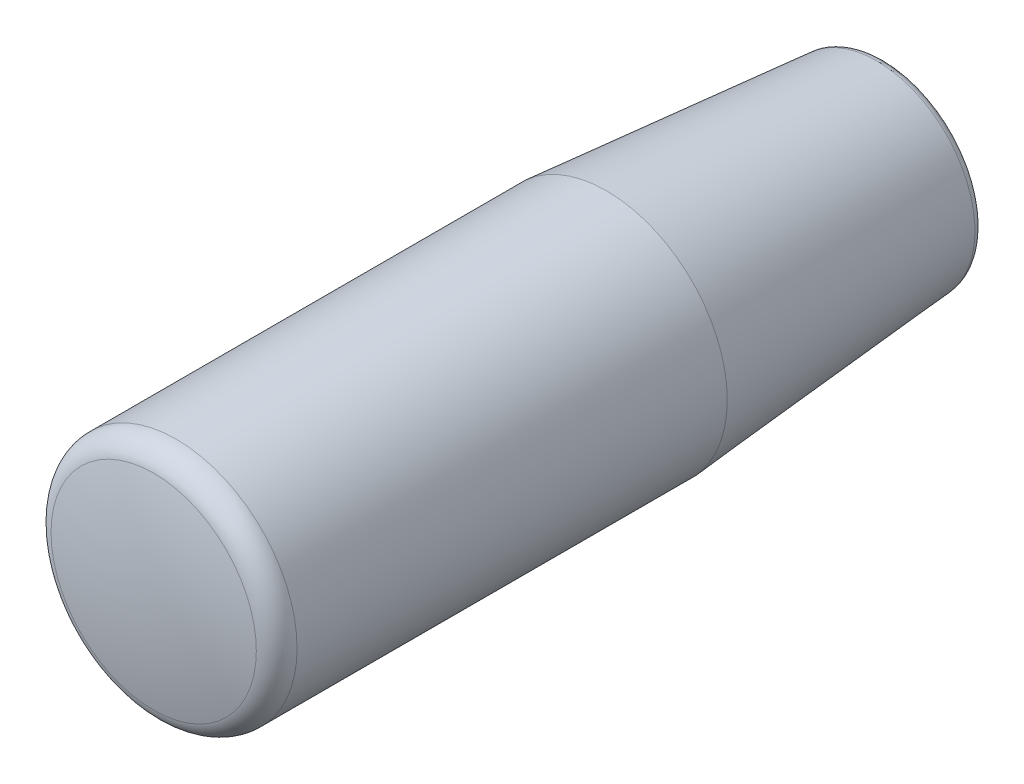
ISO-10303-21;
HEADER;
FILE_DESCRIPTION(('STEP AP214'),'2;1');
FILE_NAME('part.step','',(''),(''),'','','');
FILE_SCHEMA(('AUTOMOTIVE_DESIGN { 1 0 10303 214 1 1 1 1 }'));
ENDSEC;
DATA;
#1=APPLICATION_CONTEXT('core data for automotive mechanical design processes');
#2=APPLICATION_PROTOCOL_DEFINITION('international standard','automotive_design',2000,#1);
#3=PRODUCT_CONTEXT('',#1,'mechanical');
#4=PRODUCT('Part','Part','',(#3));
#5=PRODUCT_RELATED_PRODUCT_CATEGORY('part','',(#4));
#6=PRODUCT_DEFINITION_FORMATION('','',#4);
#7=PRODUCT_DEFINITION_CONTEXT('part definition',#1,'design');
#8=PRODUCT_DEFINITION('design','',#6,#7);
#9=PRODUCT_DEFINITION_SHAPE('','',#8);
#10=(LENGTH_UNIT() NAMED_UNIT(*) SI_UNIT(.MILLI.,.METRE.));
#11=(NAMED_UNIT(*) PLANE_ANGLE_UNIT() SI_UNIT($,.RADIAN.));
#12=(NAMED_UNIT(*) SI_UNIT($,.STERADIAN.) SOLID_ANGLE_UNIT());
#13=UNCERTAINTY_MEASURE_WITH_UNIT(LENGTH_MEASURE(1.E-05),#10,'distance_accuracy_value','');
#14=(GEOMETRIC_REPRESENTATION_CONTEXT(3) GLOBAL_UNCERTAINTY_ASSIGNED_CONTEXT((#13)) GLOBAL_UNIT_ASSIGNED_CONTEXT((#10,
#11,#12)) REPRESENTATION_CONTEXT('',''));
#15=CARTESIAN_POINT('',(0.,0.,0.));
#16=DIRECTION('',(0.,0.,1.));
#17=DIRECTION('',(1.,0.,0.));
#18=AXIS2_PLACEMENT_3D('',#15,#16,#17);
#19=CARTESIAN_POINT('',(0.,0.,76.3296652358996));
#20=DIRECTION('',(0.,0.,-1.));
#21=DIRECTION('',(-1.,0.,0.));
#22=AXIS2_PLACEMENT_3D('',#19,#20,#21);
#23=TOROIDAL_SURFACE('',#22,10.5,2.5);
#24=CARTESIAN_POINT('',(0.,0.,76.3296652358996));
#25=DIRECTION('',(0.,0.,-1.));
#26=DIRECTION('',(-1.,0.,0.));
#27=AXIS2_PLACEMENT_3D('',#24,#25,#26);
#28=CIRCLE('',#27,13.);
#29=CARTESIAN_POINT('',(-13.,0.,76.3296652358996));
#30=VERTEX_POINT('',#29);
#31=EDGE_CURVE('E9',#30,#30,#28,.T.);
#32=ORIENTED_EDGE('',*,*,#31,.F.);
#33=EDGE_LOOP('',(#32));
#34=FACE_BOUND('',#33,.T.);
#35=CARTESIAN_POINT('',(0.,0.,78.7678199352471));
#36=DIRECTION('',(0.,0.,-1.));
#37=DIRECTION('',(-1.,0.,0.));
#38=AXIS2_PLACEMENT_3D('',#35,#36,#37);
#39=CIRCLE('',#38,11.0526315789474);
#40=CARTESIAN_POINT('',(-11.0526315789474,0.,78.7678199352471));
#41=VERTEX_POINT('',#40);
#42=EDGE_CURVE('E34',#41,#41,#39,.T.);
#43=ORIENTED_EDGE('',*,*,#42,.T.);
#44=EDGE_LOOP('',(#43));
#45=FACE_BOUND('',#44,.T.);
#46=ADVANCED_FACE('F14',(#34,#45),#23,.T.);
#47=CARTESIAN_POINT('',(0.,0.,-4.99527405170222));
#48=DIRECTION('',(0.,0.,-1.));
#49=DIRECTION('',(-1.,0.,0.));
#50=AXIS2_PLACEMENT_3D('',#47,#48,#49);
#51=CYLINDRICAL_SURFACE('',#50,13.);
#52=CARTESIAN_POINT('',(0.,0.,30.0047259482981));
#53=DIRECTION('',(0.,0.,-1.));
#54=DIRECTION('',(-1.,0.,0.));
#55=AXIS2_PLACEMENT_3D('',#52,#53,#54);
#56=CIRCLE('',#55,13.);
#57=CARTESIAN_POINT('',(-13.,0.,30.0047259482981));
#58=VERTEX_POINT('',#57);
#59=EDGE_CURVE('E20',#58,#58,#56,.T.);
#60=ORIENTED_EDGE('',*,*,#59,.F.);
#61=EDGE_LOOP('',(#60));
#62=FACE_BOUND('',#61,.T.);
#63=ORIENTED_EDGE('',*,*,#31,.T.);
#64=EDGE_LOOP('',(#63));
#65=FACE_BOUND('',#64,.T.);
#66=ADVANCED_FACE('F57',(#62,#65),#51,.T.);
#67=CARTESIAN_POINT('',(0.,0.,30.0047259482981));
#68=DIRECTION('',(0.,0.,1.));
#69=DIRECTION('',(1.,0.,0.));
#70=AXIS2_PLACEMENT_3D('',#67,#68,#69);
#71=CONICAL_SURFACE('',#70,13.,0.0831412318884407);
#72=CARTESIAN_POINT('',(0.,0.,0.914449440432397));
#73=DIRECTION('',(0.,0.,-1.));
#74=DIRECTION('',(-1.,0.,0.));
#75=AXIS2_PLACEMENT_3D('',#72,#73,#74);
#76=CIRCLE('',#75,10.5758102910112);
#77=CARTESIAN_POINT('',(-10.5758102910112,0.,0.914449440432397));
#78=VERTEX_POINT('',#77);
#79=EDGE_CURVE('E50',#78,#78,#76,.T.);
#80=ORIENTED_EDGE('',*,*,#79,.F.);
#81=EDGE_LOOP('',(#80));
#82=FACE_BOUND('',#81,.T.);
#83=ORIENTED_EDGE('',*,*,#59,.T.);
#84=EDGE_LOOP('',(#83));
#85=FACE_BOUND('',#84,.T.);
#86=ADVANCED_FACE('F55',(#82,#85),#71,.T.);
#87=CARTESIAN_POINT('',(0.,0.,0.997494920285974));
#88=DIRECTION('',(0.,0.,-1.));
#89=DIRECTION('',(-1.,0.,0.));
#90=AXIS2_PLACEMENT_3D('',#87,#88,#89);
#91=TOROIDAL_SURFACE('',#90,9.57926453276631,1.);
#92=CARTESIAN_POINT('',(0.,0.,-0.00250479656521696));
#93=DIRECTION('',(0.,0.,-1.));
#94=DIRECTION('',(-1.,0.,0.));
#95=AXIS2_PLACEMENT_3D('',#92,#93,#94);
#96=CIRCLE('',#95,9.57851200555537);
#97=CARTESIAN_POINT('',(-9.57851200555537,0.,-0.00250479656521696));
#98=VERTEX_POINT('',#97);
#99=EDGE_CURVE('E47',#98,#98,#96,.T.);
#100=ORIENTED_EDGE('',*,*,#99,.F.);
#101=EDGE_LOOP('',(#100));
#102=FACE_BOUND('',#101,.T.);
#103=ORIENTED_EDGE('',*,*,#79,.T.);
#104=EDGE_LOOP('',(#103));
#105=FACE_BOUND('',#104,.T.);
#106=ADVANCED_FACE('F86',(#102,#105),#91,.T.);
#107=CARTESIAN_POINT('',(0.,0.,-0.00250479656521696));
#108=DIRECTION('',(0.,0.,-1.));
#109=DIRECTION('',(-1.,0.,0.));
#110=AXIS2_PLACEMENT_3D('',#107,#108,#109);
#111=CONICAL_SURFACE('',#110,9.57851200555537,1.57004379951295);
#112=CARTESIAN_POINT('',(0.,0.,0.));
#113=DIRECTION('',(0.,0.,-1.));
#114=DIRECTION('',(-1.,0.,0.));
#115=AXIS2_PLACEMENT_3D('',#112,#113,#114);
#116=CIRCLE('',#115,6.25);
#117=CARTESIAN_POINT('',(-6.25,0.,0.));
#118=VERTEX_POINT('',#117);
#119=EDGE_CURVE('E44',#118,#118,#116,.T.);
#120=ORIENTED_EDGE('',*,*,#119,.F.);
#121=EDGE_LOOP('',(#120));
#122=FACE_BOUND('',#121,.T.);
#123=ORIENTED_EDGE('',*,*,#99,.T.);
#124=EDGE_LOOP('',(#123));
#125=FACE_BOUND('',#124,.T.);
#126=ADVANCED_FACE('F82',(#122,#125),#111,.F.);
#127=CARTESIAN_POINT('',(0.,0.,-4.99527405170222));
#128=DIRECTION('',(0.,0.,-1.));
#129=DIRECTION('',(-1.,0.,0.));
#130=AXIS2_PLACEMENT_3D('',#127,#128,#129);
#131=CYLINDRICAL_SURFACE('',#130,6.25);
#132=CARTESIAN_POINT('',(0.,0.,10.));
#133=DIRECTION('',(0.,0.,-1.));
#134=DIRECTION('',(-1.,0.,0.));
#135=AXIS2_PLACEMENT_3D('',#132,#133,#134);
#136=CIRCLE('',#135,6.25);
#137=CARTESIAN_POINT('',(-6.25,0.,10.));
#138=VERTEX_POINT('',#137);
#139=EDGE_CURVE('E37',#138,#138,#136,.T.);
#140=ORIENTED_EDGE('',*,*,#139,.F.);
#141=EDGE_LOOP('',(#140));
#142=FACE_BOUND('',#141,.T.);
#143=ORIENTED_EDGE('',*,*,#119,.T.);
#144=EDGE_LOOP('',(#143));
#145=FACE_BOUND('',#144,.T.);
#146=ADVANCED_FACE('F78',(#142,#145),#131,.F.);
#147=CARTESIAN_POINT('',(0.,0.,10.));
#148=DIRECTION('',(0.,0.,-1.));
#149=DIRECTION('',(-1.,0.,0.));
#150=AXIS2_PLACEMENT_3D('',#147,#148,#149);
#151=CONICAL_SURFACE('',#150,6.25,1.5518947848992);
#152=CARTESIAN_POINT('',(0.,0.,10.0047259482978));
#153=DIRECTION('',(0.,0.,-1.));
#154=DIRECTION('',(-1.,0.,0.));
#155=AXIS2_PLACEMENT_3D('',#152,#153,#154);
#156=CIRCLE('',#155,6.);
#157=CARTESIAN_POINT('',(-6.,0.,10.0047259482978));
#158=VERTEX_POINT('',#157);
#159=EDGE_CURVE('E33',#158,#158,#156,.T.);
#160=ORIENTED_EDGE('',*,*,#159,.F.);
#161=EDGE_LOOP('',(#160));
#162=FACE_BOUND('',#161,.T.);
#163=ORIENTED_EDGE('',*,*,#139,.T.);
#164=EDGE_LOOP('',(#163));
#165=FACE_BOUND('',#164,.T.);
#166=ADVANCED_FACE('F75',(#162,#165),#151,.F.);
#167=CARTESIAN_POINT('',(0.,0.,-4.99527405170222));
#168=DIRECTION('',(0.,0.,-1.));
#169=DIRECTION('',(-1.,0.,0.));
#170=AXIS2_PLACEMENT_3D('',#167,#168,#169);
#171=CYLINDRICAL_SURFACE('',#170,6.);
#172=CARTESIAN_POINT('',(0.,0.,55.0002037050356));
#173=DIRECTION('',(0.,0.,-1.));
#174=DIRECTION('',(-1.,0.,0.));
#175=AXIS2_PLACEMENT_3D('',#172,#173,#174);
#176=CIRCLE('',#175,6.);
#177=CARTESIAN_POINT('',(-6.,0.,55.0002037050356));
#178=VERTEX_POINT('',#177);
#179=EDGE_CURVE('E31',#178,#178,#176,.T.);
#180=ORIENTED_EDGE('',*,*,#179,.F.);
#181=EDGE_LOOP('',(#180));
#182=FACE_BOUND('',#181,.T.);
#183=ORIENTED_EDGE('',*,*,#159,.T.);
#184=EDGE_LOOP('',(#183));
#185=FACE_BOUND('',#184,.T.);
#186=ADVANCED_FACE('F27',(#182,#185),#171,.F.);
#187=CARTESIAN_POINT('',(0.,0.,55.0002037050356));
#188=DIRECTION('',(0.,0.,-1.));
#189=DIRECTION('',(-1.,0.,0.));
#190=AXIS2_PLACEMENT_3D('',#187,#188,#189);
#191=CONICAL_SURFACE('',#190,6.,1.57004379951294);
#192=CARTESIAN_POINT('',(0.,0.,55.0047188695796));
#193=VERTEX_POINT('',#192);
#194=VERTEX_LOOP('',#193);
#195=FACE_BOUND('',#194,.T.);
#196=ORIENTED_EDGE('',*,*,#179,.T.);
#197=EDGE_LOOP('',(#196));
#198=FACE_BOUND('',#197,.T.);
#199=ADVANCED_FACE('F23',(#195,#198),#191,.F.);
#200=CARTESIAN_POINT('',(0.,0.,30.0047259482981));
#201=DIRECTION('',(-1.,0.,0.));
#202=DIRECTION('',(0.,0.,1.));
#203=AXIS2_PLACEMENT_3D('',#200,#201,#202);
#204=SPHERICAL_SURFACE('',#203,50.);
#205=CARTESIAN_POINT('',(0.,0.,30.0047259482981));
#206=DIRECTION('',(0.,0.,-1.));
#207=DIRECTION('',(-1.,0.,0.));
#208=AXIS2_PLACEMENT_3D('',#205,#206,#207);
#209=SPHERICAL_SURFACE('',#208,50.);
#210=ORIENTED_EDGE('',*,*,#42,.F.);
#211=EDGE_LOOP('',(#210));
#212=FACE_BOUND('',#211,.T.);
#213=ADVANCED_FACE('F26',(#212),#209,.T.);
#214=CLOSED_SHELL('',(#46,#66,#86,#106,#126,#146,#166,#186,#199,#213));
#215=MANIFOLD_SOLID_BREP('B1',#214);
#216=ADVANCED_BREP_SHAPE_REPRESENTATION('',(#18,#215),#14);
#217=SHAPE_DEFINITION_REPRESENTATION(#9,#216);
ENDSEC;
END-ISO-10303-21;
